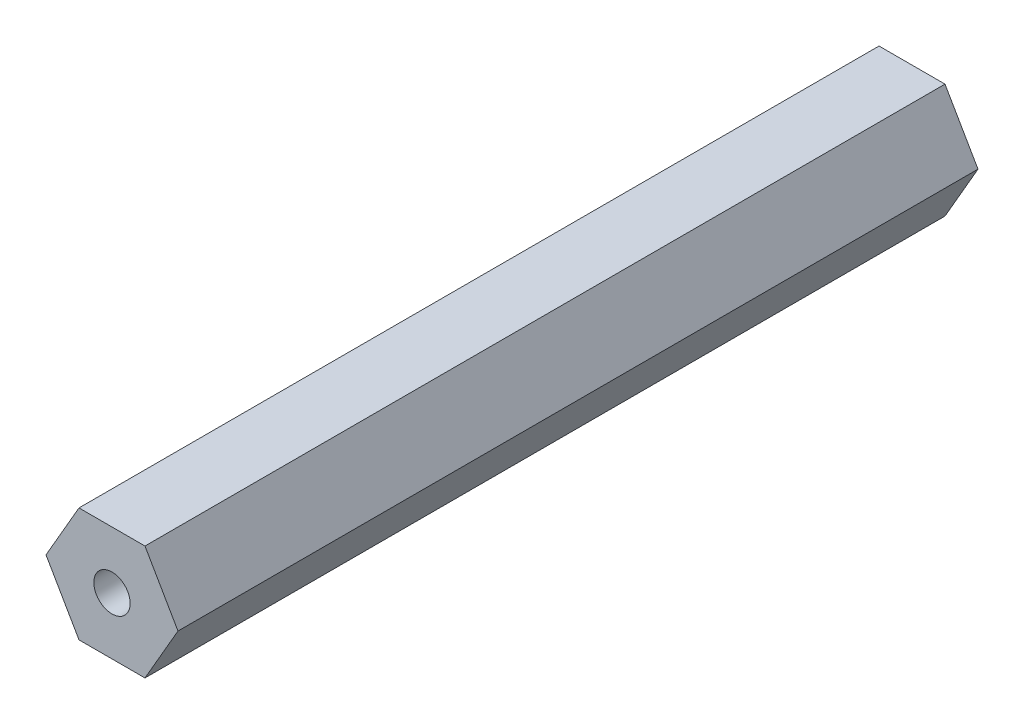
from build123d import *

# Parameters (mm, degrees)
BOSS_EXTRUDE1_DEPTH        = 88.9
F_10_32_TAPPED_HOLE2_D     = 4.0386
F_10_32_TAPPED_HOLE2_DEPTH = 12.7
F_10_32_TAPPED_HOLE2_TIP   = 1.213317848


with BuildPart() as part:
    # Sketch2 → Boss-Extrude1 (new body)
    with BuildSketch(Plane.XY):
        Polygon((7.332348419, 0), (3.666174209, 6.35), (-3.666174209, 6.35), (-7.332348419, 0), (-3.666174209, -6.35), (3.666174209, -6.35), align=None)
    extrude(amount=BOSS_EXTRUDE1_DEPTH)

    # Sketch7 → 10-32 Tapped Hole1 (revolve, cut)
    with BuildSketch(Plane(origin=(0, 0, 88.9), x_dir=(0, -1, 0), z_dir=(1, 0, 0))):
        Polygon((0, 0), (0, 13.913317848), (2.0193, 12.7), (2.0193, 0), align=None)
    revolve(axis=Axis((0, 0, 95.25), (0, 0, -1)), mode=Mode.SUBTRACT)

    # 10-32 Tapped Hole2
    with Locations(Plane(origin=(0, 0, 0), x_dir=(-1, 0, 0), z_dir=(0, 0, -1))):
        with Locations((0, 0)):
            Hole(F_10_32_TAPPED_HOLE2_D / 2, depth=F_10_32_TAPPED_HOLE2_DEPTH)
            with Locations((0, 0, -(F_10_32_TAPPED_HOLE2_DEPTH + F_10_32_TAPPED_HOLE2_TIP / 2))):  # 118° drill point
                Cone(0, F_10_32_TAPPED_HOLE2_D / 2, F_10_32_TAPPED_HOLE2_TIP, mode=Mode.SUBTRACT)


solid = part.part
